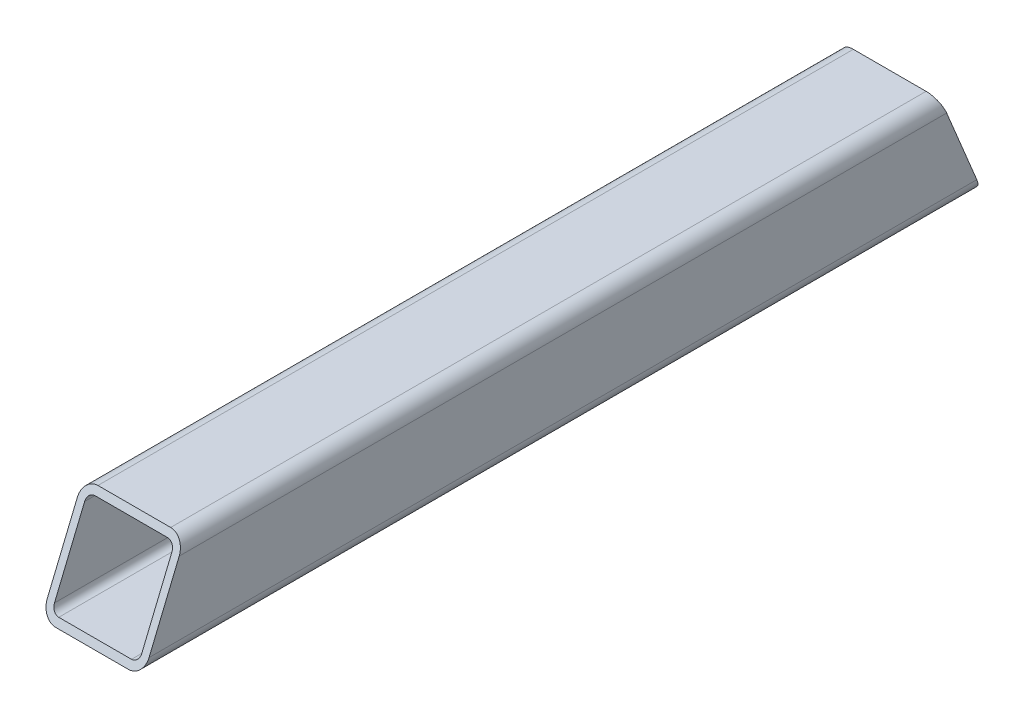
from build123d import *

# Parameters (mm, degrees)
BOSS_EXTRU_1_DEPTH      = 297
ENL_V_MAT_EXTRU_1_DEPTH = 308.138405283


with BuildPart() as part:
    # Esquisse1 → Boss.-Extru.1 (new, symmetric)
    with BuildSketch(Plane.XY):
        with BuildLine():
            Line((-25, 35), (25, 35))
            ThreePointArc((25, 35), (32.071067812, 32.071067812), (35, 25))
            Line((35, 25), (35, -25))
            ThreePointArc((35, -25), (32.071067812, -32.071067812), (25, -35))
            Line((25, -35), (-25, -35))
            ThreePointArc((-25, -35), (-32.071067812, -32.071067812), (-35, -25))
            Line((-35, -25), (-35, 25))
            ThreePointArc((-35, 25), (-32.071067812, 32.071067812), (-25, 35))
        make_face()
        with BuildLine():
            Line((-25, 30), (25, 30))
            ThreePointArc((25, 30), (28.535533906, 28.535533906), (30, 25))
            Line((30, 25), (30, -25))
            ThreePointArc((30, -25), (28.535533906, -28.535533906), (25, -30))
            Line((25, -30), (-25, -30))
            ThreePointArc((-25, -30), (-28.535533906, -28.535533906), (-30, -25))
            Line((-30, -25), (-30, 25))
            ThreePointArc((-30, 25), (-28.535533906, 28.535533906), (-25, 30))
        make_face(mode=Mode.SUBTRACT)
    extrude(amount=BOSS_EXTRU_1_DEPTH, both=True)

    # Esquisse2 → Enl_v. mat.-Extru.1 (cut, symmetric)
    with BuildSketch(Plane(origin=(35, 0, 0), x_dir=(0, 0, -1), z_dir=(1, 0, 0))):
        Polygon((-266.619119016, 1305.294921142), (208.523345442, 158.199539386), (297, -55.402), (297, 127.41308021), (297, 1369.020174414), (18.014447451, 3836.512781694), (-545.604671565, 3772.787528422), align=None)
    enl_v_mat_extru_1 = extrude(amount=ENL_V_MAT_EXTRU_1_DEPTH, both=True, mode=Mode.SUBTRACT)

    # Sym_trie1: Enl_v. mat.-Extru.1 across plane
    add(enl_v_mat_extru_1.mirror(Plane.XY), mode=Mode.SUBTRACT)


solid = part.part
